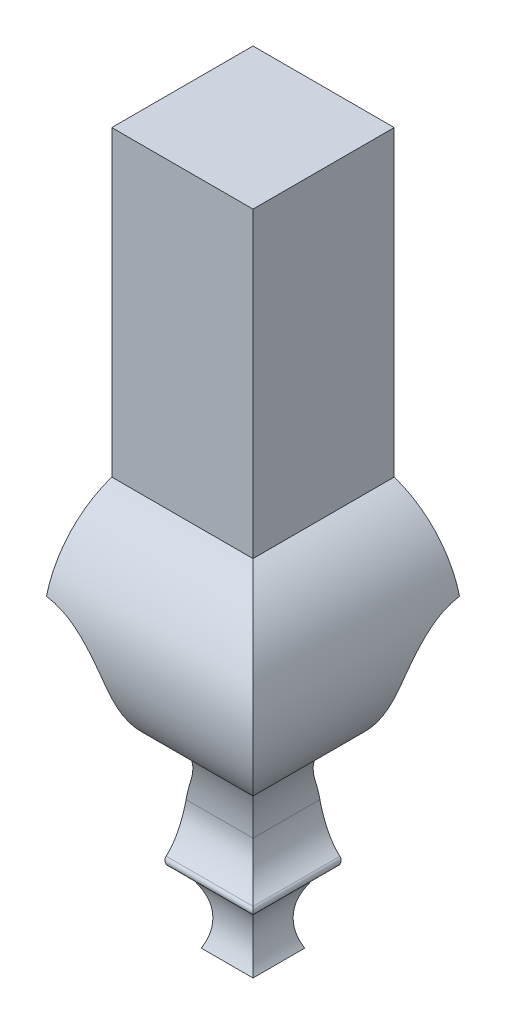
from build123d import *

# Parameters (mm, degrees)
CROQUIS1_W               = 120
CROQUIS1_H               = 120
SALIENTE_EXTRUIR1_DEPTH  = 175
CROQUIS2_W               = 120
CROQUIS2_H               = 350
SIERRA_CITA_PERFIL_DEPTH = 195.486503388
REDONDEO1_R              = 2
ESCOPLEADO_DEPTH         = 27


with BuildPart() as part:
    # Croquis1 → Saliente-Extruir1 (new, symmetric)
    with BuildSketch(Plane(origin=(0, 0, 0), x_dir=(1, 0, 0), z_dir=(0, 1, 0))):
        Rectangle(CROQUIS1_W, CROQUIS1_H)
    extrude(amount=SALIENTE_EXTRUIR1_DEPTH, both=True)

    # Croquis2 → Sierra Cita - perfil (cut, symmetric)
    with BuildSketch(Plane.XY):
        Rectangle(CROQUIS2_W, CROQUIS2_H)
        with BuildLine():
            Line((20, 70), (20, 20))
            ThreePointArc((20, 20), (53.610728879, -21.821030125), (30, -70))
            ThreePointArc((30, -70), (11.576010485, -89.208894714), (5, -115))
            ThreePointArc((5, -115), (9.209905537, -127.467570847), (20, -135))
            ThreePointArc((20, -135), (5.730146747, -149.851470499), (10, -170))
            Line((10, -170), (-15.645016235, -170))
            ThreePointArc((-15.645016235, -170), (-14.952131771, -157.934402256), (-20, -146.953611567))
            ThreePointArc((-20, -146.953611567), (-28.491094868, -126.690819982), (-25, -105))
            ThreePointArc((-25, -105), (-16.569085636, -72.956224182), (-20, -40))
            ThreePointArc((-20, -40), (-31.1892224, -22.92706688), (-50, -15))
            Line((-50, -15), (-50, 70))
            Line((-50, 70), (-50, 170))
            Line((-50, 170), (20, 170))
            Line((20, 170), (20, 70))
        make_face(mode=Mode.SUBTRACT)
    sierra_cita_perfil = extrude(amount=SIERRA_CITA_PERFIL_DEPTH, both=True, mode=Mode.SUBTRACT)

    # Simetr_a1: Sierra Cita - perfil across plane
    add(sierra_cita_perfil.mirror(Plane(origin=(0, 0, 0), x_dir=(0.7071067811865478, 0, 0.7071067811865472), z_dir=(0.7071067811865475, 0, -0.7071067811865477))), mode=Mode.SUBTRACT)

    # Redondeo1
    redondeo1_edges = [part.edges().sort_by_distance(p)[0] for p in [
        (20, -135, -3.292992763),
        (-3.292992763, -135, 20),
    ]]
    fillet(redondeo1_edges, radius=REDONDEO1_R)

    # Croquis3 → Escopleado (cut)
    with BuildSketch(Plane.ZY.offset(50)):
        with BuildLine():
            Line((3, 132.5), (3, 57.5))
            ThreePointArc((3, 57.5), (-5, 49.5), (-13, 57.5))
            Line((-13, 57.5), (-13, 132.5))
            ThreePointArc((-13, 132.5), (-5, 140.5), (3, 132.5))
        make_face()
    escopleado = extrude(amount=-ESCOPLEADO_DEPTH, mode=Mode.SUBTRACT)

    # Simetr_a2: Escopleado across plane
    add(escopleado.mirror(Plane(origin=(0, 0, 0), x_dir=(0.7071067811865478, 0, 0.7071067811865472), z_dir=(0.7071067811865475, 0, -0.7071067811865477))), mode=Mode.SUBTRACT)


solid = part.part
